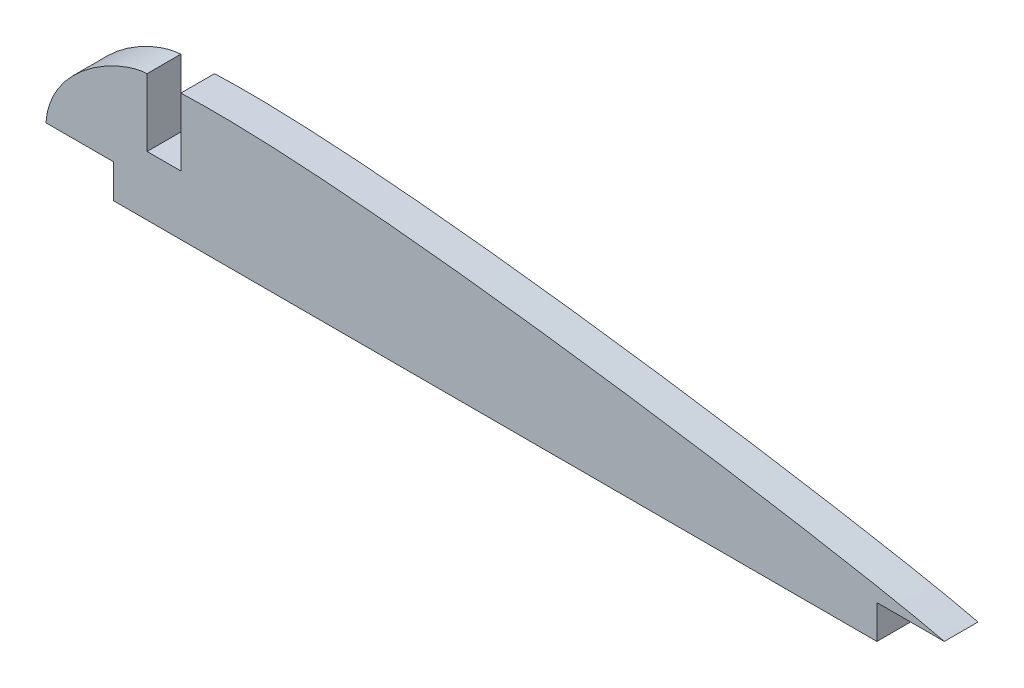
from build123d import *

# Parameters (mm, degrees)
BOSS_EXTRUDE1_DEPTH = 3.175


with BuildPart() as part:
    # Sketch2 → Boss-Extrude1 (new body)
    with BuildSketch(Plane.XY):
        with BuildLine():
            Line((0, 26.799063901), (3.175, 26.799063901))
            Line((3.175, 26.799063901), (3.175, 33.149063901))
            add(Edge.make_bspline(
                [(3.175, 33.149063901), (21.696989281, 33.925189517), (66.036905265, 26.661864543), (75.102500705, 24.37362821)],
                knots=[0, 0, 0, 0, 1, 1, 1, 1], degree=3))
            Line((75.102500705, 24.37362821), (68.752500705, 24.37362821))
            Line((68.752500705, 24.37362821), (68.752500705, 21.19862821))
            Line((68.752500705, 21.19862821), (3.175, 21.19862821))
            Line((3.175, 21.19862821), (-3.175, 21.19862821))
            Line((-3.175, 21.19862821), (-3.175, 24.37362821))
            Line((-3.175, 24.37362821), (-9.525, 24.37362821))
            add(Edge.make_bspline(
                [(0, 33.149063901), (-2.8543204, 33.027412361), (-9.199860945, 29.453952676), (-9.525, 24.37362821)],
                knots=[0, 0, 0, 0, 1, 1, 1, 1], degree=3))
            Line((0, 33.149063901), (0, 26.799063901))
        make_face()
    extrude(amount=BOSS_EXTRUDE1_DEPTH)


solid = part.part
